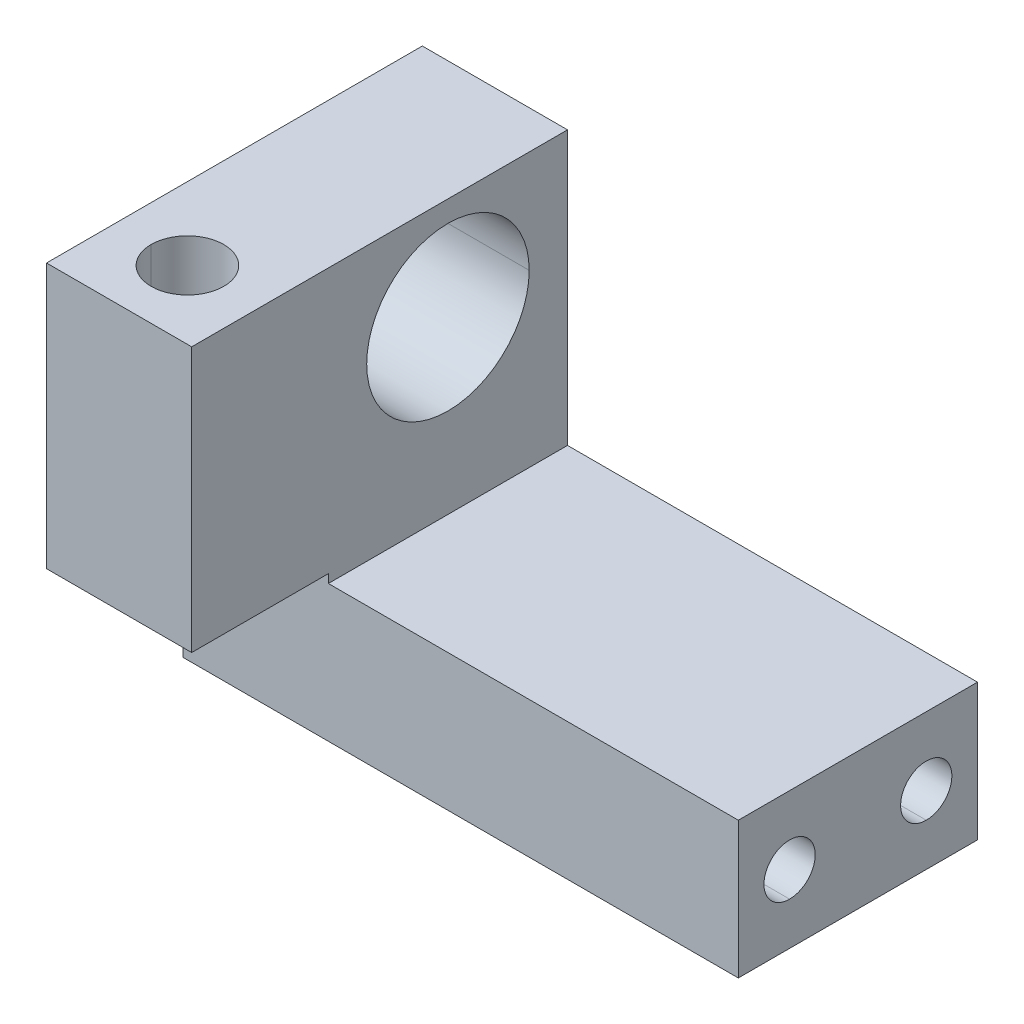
ISO-10303-21;
HEADER;
FILE_DESCRIPTION(('STEP AP214'),'2;1');
FILE_NAME('part.step','',(''),(''),'','','');
FILE_SCHEMA(('AUTOMOTIVE_DESIGN { 1 0 10303 214 1 1 1 1 }'));
ENDSEC;
DATA;
#1=APPLICATION_CONTEXT('core data for automotive mechanical design processes');
#2=APPLICATION_PROTOCOL_DEFINITION('international standard','automotive_design',2000,#1);
#3=PRODUCT_CONTEXT('',#1,'mechanical');
#4=PRODUCT('Part','Part','',(#3));
#5=PRODUCT_RELATED_PRODUCT_CATEGORY('part','',(#4));
#6=PRODUCT_DEFINITION_FORMATION('','',#4);
#7=PRODUCT_DEFINITION_CONTEXT('part definition',#1,'design');
#8=PRODUCT_DEFINITION('design','',#6,#7);
#9=PRODUCT_DEFINITION_SHAPE('','',#8);
#10=(LENGTH_UNIT() NAMED_UNIT(*) SI_UNIT(.MILLI.,.METRE.));
#11=(NAMED_UNIT(*) PLANE_ANGLE_UNIT() SI_UNIT($,.RADIAN.));
#12=(NAMED_UNIT(*) SI_UNIT($,.STERADIAN.) SOLID_ANGLE_UNIT());
#13=UNCERTAINTY_MEASURE_WITH_UNIT(LENGTH_MEASURE(1.E-05),#10,'distance_accuracy_value','');
#14=(GEOMETRIC_REPRESENTATION_CONTEXT(3) GLOBAL_UNCERTAINTY_ASSIGNED_CONTEXT((#13)) GLOBAL_UNIT_ASSIGNED_CONTEXT((#10,
#11,#12)) REPRESENTATION_CONTEXT('',''));
#15=CARTESIAN_POINT('',(0.,0.,0.));
#16=DIRECTION('',(0.,0.,1.));
#17=DIRECTION('',(1.,0.,0.));
#18=AXIS2_PLACEMENT_3D('',#15,#16,#17);
#19=CARTESIAN_POINT('',(-38.1,12.6999999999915,22.2249999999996));
#20=DIRECTION('',(0.,-1.,0.));
#21=DIRECTION('',(0.,0.,-1.));
#22=AXIS2_PLACEMENT_3D('',#19,#20,#21);
#23=CYLINDRICAL_SURFACE('',#22,6.746875);
#24=CARTESIAN_POINT('',(-38.1,-11.1125000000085,22.2249999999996));
#25=DIRECTION('',(0.,-1.,0.));
#26=DIRECTION('',(0.,0.,-1.));
#27=AXIS2_PLACEMENT_3D('',#24,#25,#26);
#28=CIRCLE('',#27,6.746875);
#29=CARTESIAN_POINT('',(-44.846875,-11.1125000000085,22.2249999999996));
#30=VERTEX_POINT('',#29);
#31=CARTESIAN_POINT('',(-31.353125,-11.1125000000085,22.2249999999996));
#32=VERTEX_POINT('',#31);
#33=EDGE_CURVE('E140',#30,#32,#28,.F.);
#34=ORIENTED_EDGE('',*,*,#33,.F.);
#35=DIRECTION('',(0.,-1.,0.));
#36=VECTOR('',#35,1.);
#37=CARTESIAN_POINT('',(-44.846875,12.6999999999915,22.2249999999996));
#38=LINE('',#37,#36);
#39=CARTESIAN_POINT('',(-44.846875,38.0999999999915,22.2249999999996));
#40=VERTEX_POINT('',#39);
#41=EDGE_CURVE('E132',#30,#40,#38,.F.);
#42=ORIENTED_EDGE('',*,*,#41,.T.);
#43=CARTESIAN_POINT('',(-38.1,38.0999999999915,22.2249999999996));
#44=DIRECTION('',(0.,-1.,0.));
#45=DIRECTION('',(0.,0.,-1.));
#46=AXIS2_PLACEMENT_3D('',#43,#44,#45);
#47=CIRCLE('',#46,6.746875);
#48=CARTESIAN_POINT('',(-31.353125,38.0999999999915,22.2249999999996));
#49=VERTEX_POINT('',#48);
#50=EDGE_CURVE('E189',#49,#40,#47,.T.);
#51=ORIENTED_EDGE('',*,*,#50,.F.);
#52=DIRECTION('',(0.,-1.,0.));
#53=VECTOR('',#52,1.);
#54=CARTESIAN_POINT('',(-31.353125,12.6999999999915,22.2249999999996));
#55=LINE('',#54,#53);
#56=EDGE_CURVE('E127',#49,#32,#55,.T.);
#57=ORIENTED_EDGE('',*,*,#56,.T.);
#58=EDGE_LOOP('',(#34,#42,#51,#57));
#59=FACE_BOUND('',#58,.T.);
#60=ADVANCED_FACE('F16',(#59),#23,.F.);
#61=CARTESIAN_POINT('',(-38.1,12.6999999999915,22.2249999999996));
#62=DIRECTION('',(0.,-1.,0.));
#63=DIRECTION('',(0.,0.,-1.));
#64=AXIS2_PLACEMENT_3D('',#61,#62,#63);
#65=CYLINDRICAL_SURFACE('',#64,6.746875);
#66=CARTESIAN_POINT('',(-38.1,38.0999999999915,22.2249999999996));
#67=DIRECTION('',(0.,-1.,0.));
#68=DIRECTION('',(0.,0.,-1.));
#69=AXIS2_PLACEMENT_3D('',#66,#67,#68);
#70=CIRCLE('',#69,6.746875);
#71=EDGE_CURVE('E137',#40,#49,#70,.T.);
#72=ORIENTED_EDGE('',*,*,#71,.F.);
#73=ORIENTED_EDGE('',*,*,#41,.F.);
#74=CARTESIAN_POINT('',(-38.1,-11.1125000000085,22.2249999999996));
#75=DIRECTION('',(0.,-1.,0.));
#76=DIRECTION('',(0.,0.,-1.));
#77=AXIS2_PLACEMENT_3D('',#74,#75,#76);
#78=CIRCLE('',#77,6.746875);
#79=EDGE_CURVE('E19',#32,#30,#78,.F.);
#80=ORIENTED_EDGE('',*,*,#79,.F.);
#81=ORIENTED_EDGE('',*,*,#56,.F.);
#82=EDGE_LOOP('',(#72,#73,#80,#81));
#83=FACE_BOUND('',#82,.T.);
#84=ADVANCED_FACE('F133',(#83),#65,.F.);
#85=CARTESIAN_POINT('',(19.84375,-25.3999999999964,-25.4));
#86=DIRECTION('',(-1.,0.,0.));
#87=DIRECTION('',(0.,0.,1.));
#88=AXIS2_PLACEMENT_3D('',#85,#86,#87);
#89=PLANE('',#88);
#90=CARTESIAN_POINT('',(19.84375,-25.3999999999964,-25.4));
#91=DIRECTION('',(-1.,0.,0.));
#92=DIRECTION('',(0.,0.,1.));
#93=AXIS2_PLACEMENT_3D('',#90,#91,#92);
#94=CIRCLE('',#93,4.7625);
#95=CARTESIAN_POINT('',(19.84375,-30.1624999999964,-25.4));
#96=VERTEX_POINT('',#95);
#97=CARTESIAN_POINT('',(19.84375,-20.6374999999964,-25.4));
#98=VERTEX_POINT('',#97);
#99=EDGE_CURVE('E177',#96,#98,#94,.F.);
#100=ORIENTED_EDGE('',*,*,#99,.T.);
#101=CARTESIAN_POINT('',(19.84375,-25.3999999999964,-25.4));
#102=DIRECTION('',(-1.,0.,0.));
#103=DIRECTION('',(0.,0.,1.));
#104=AXIS2_PLACEMENT_3D('',#101,#102,#103);
#105=CIRCLE('',#104,4.7625);
#106=EDGE_CURVE('E174',#98,#96,#105,.F.);
#107=ORIENTED_EDGE('',*,*,#106,.T.);
#108=EDGE_LOOP('',(#100,#107));
#109=FACE_BOUND('',#108,.T.);
#110=ADVANCED_FACE('F340',(#109),#89,.F.);
#111=CARTESIAN_POINT('',(19.84375,-25.3999999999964,0.));
#112=DIRECTION('',(-1.,0.,0.));
#113=DIRECTION('',(0.,0.,1.));
#114=AXIS2_PLACEMENT_3D('',#111,#112,#113);
#115=PLANE('',#114);
#116=CARTESIAN_POINT('',(19.84375,-25.3999999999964,0.));
#117=DIRECTION('',(-1.,0.,0.));
#118=DIRECTION('',(0.,0.,1.));
#119=AXIS2_PLACEMENT_3D('',#116,#117,#118);
#120=CIRCLE('',#119,4.7625);
#121=CARTESIAN_POINT('',(19.84375,-30.1624999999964,0.));
#122=VERTEX_POINT('',#121);
#123=CARTESIAN_POINT('',(19.84375,-20.6374999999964,0.));
#124=VERTEX_POINT('',#123);
#125=EDGE_CURVE('E171',#122,#124,#120,.F.);
#126=ORIENTED_EDGE('',*,*,#125,.T.);
#127=CARTESIAN_POINT('',(19.84375,-25.3999999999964,0.));
#128=DIRECTION('',(-1.,0.,0.));
#129=DIRECTION('',(0.,0.,1.));
#130=AXIS2_PLACEMENT_3D('',#127,#128,#129);
#131=CIRCLE('',#130,4.7625);
#132=EDGE_CURVE('E167',#124,#122,#131,.F.);
#133=ORIENTED_EDGE('',*,*,#132,.T.);
#134=EDGE_LOOP('',(#126,#133));
#135=FACE_BOUND('',#134,.T.);
#136=ADVANCED_FACE('F337',(#135),#115,.F.);
#137=CARTESIAN_POINT('',(-38.1,-11.1125000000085,22.2249999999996));
#138=DIRECTION('',(0.,-1.,0.));
#139=DIRECTION('',(0.,0.,-1.));
#140=AXIS2_PLACEMENT_3D('',#137,#138,#139);
#141=PLANE('',#140);
#142=DIRECTION('',(0.,0.,1.));
#143=VECTOR('',#142,1.);
#144=CARTESIAN_POINT('',(-51.59375,-11.1125000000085,15.8749999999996));
#145=LINE('',#144,#143);
#146=CARTESIAN_POINT('',(-51.59375,-11.1125000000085,9.52499999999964));
#147=VERTEX_POINT('',#146);
#148=CARTESIAN_POINT('',(-51.59375,-11.1125000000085,34.9249999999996));
#149=VERTEX_POINT('',#148);
#150=EDGE_CURVE('E205',#147,#149,#145,.T.);
#151=ORIENTED_EDGE('',*,*,#150,.F.);
#152=DIRECTION('',(1.,0.,0.));
#153=VECTOR('',#152,1.);
#154=CARTESIAN_POINT('',(-5.55625,-11.1125000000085,9.52499999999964));
#155=LINE('',#154,#153);
#156=CARTESIAN_POINT('',(-24.60625,-11.1125000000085,9.52499999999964));
#157=VERTEX_POINT('',#156);
#158=EDGE_CURVE('E220',#157,#147,#155,.F.);
#159=ORIENTED_EDGE('',*,*,#158,.F.);
#160=DIRECTION('',(0.,0.,-1.));
#161=VECTOR('',#160,1.);
#162=CARTESIAN_POINT('',(-24.60625,-11.1125000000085,15.8749999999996));
#163=LINE('',#162,#161);
#164=CARTESIAN_POINT('',(-24.60625,-11.1125000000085,34.9249999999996));
#165=VERTEX_POINT('',#164);
#166=EDGE_CURVE('E183',#165,#157,#163,.T.);
#167=ORIENTED_EDGE('',*,*,#166,.F.);
#168=DIRECTION('',(-1.,0.,0.));
#169=VECTOR('',#168,1.);
#170=CARTESIAN_POINT('',(-24.60625,-11.1125000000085,34.9249999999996));
#171=LINE('',#170,#169);
#172=EDGE_CURVE('E142',#165,#149,#171,.T.);
#173=ORIENTED_EDGE('',*,*,#172,.T.);
#174=EDGE_LOOP('',(#151,#159,#167,#173));
#175=FACE_BOUND('',#174,.T.);
#176=ORIENTED_EDGE('',*,*,#79,.T.);
#177=ORIENTED_EDGE('',*,*,#33,.T.);
#178=EDGE_LOOP('',(#176,#177));
#179=FACE_BOUND('',#178,.T.);
#180=ADVANCED_FACE('F143',(#175,#179),#141,.T.);
#181=CARTESIAN_POINT('',(-24.60625,-12.7000000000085,34.9249999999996));
#182=DIRECTION('',(0.,0.,-1.));
#183=DIRECTION('',(-1.,0.,0.));
#184=AXIS2_PLACEMENT_3D('',#181,#182,#183);
#185=PLANE('',#184);
#186=DIRECTION('',(0.,1.,0.));
#187=VECTOR('',#186,1.);
#188=CARTESIAN_POINT('',(-24.60625,38.1,34.9249999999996));
#189=LINE('',#188,#187);
#190=CARTESIAN_POINT('',(-24.60625,38.0999999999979,34.9249999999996));
#191=VERTEX_POINT('',#190);
#192=EDGE_CURVE('E179',#191,#165,#189,.F.);
#193=ORIENTED_EDGE('',*,*,#192,.F.);
#194=DIRECTION('',(1.,0.,0.));
#195=VECTOR('',#194,1.);
#196=CARTESIAN_POINT('',(-51.59375,38.1,34.9249999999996));
#197=LINE('',#196,#195);
#198=CARTESIAN_POINT('',(-51.59375,38.0999999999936,34.9249999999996));
#199=VERTEX_POINT('',#198);
#200=EDGE_CURVE('E187',#199,#191,#197,.T.);
#201=ORIENTED_EDGE('',*,*,#200,.F.);
#202=DIRECTION('',(0.,1.,0.));
#203=VECTOR('',#202,1.);
#204=CARTESIAN_POINT('',(-51.59375,-27.7622000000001,34.9249999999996));
#205=LINE('',#204,#203);
#206=EDGE_CURVE('E211',#149,#199,#205,.T.);
#207=ORIENTED_EDGE('',*,*,#206,.F.);
#208=ORIENTED_EDGE('',*,*,#172,.F.);
#209=EDGE_LOOP('',(#193,#201,#207,#208));
#210=FACE_BOUND('',#209,.T.);
#211=ADVANCED_FACE('F212',(#210),#185,.F.);
#212=CARTESIAN_POINT('',(-37.30625,19.0500000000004,-12.7000000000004));
#213=DIRECTION('',(1.,0.,0.));
#214=DIRECTION('',(0.,1.,0.));
#215=AXIS2_PLACEMENT_3D('',#212,#213,#214);
#216=CYLINDRICAL_SURFACE('',#215,15.1003);
#217=CARTESIAN_POINT('',(-24.60625,19.0500000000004,-12.7000000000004));
#218=DIRECTION('',(1.,0.,0.));
#219=DIRECTION('',(0.,1.,0.));
#220=AXIS2_PLACEMENT_3D('',#217,#218,#219);
#221=CIRCLE('',#220,15.1003);
#222=CARTESIAN_POINT('',(-24.60625,19.0500000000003,-27.8003000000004));
#223=VERTEX_POINT('',#222);
#224=CARTESIAN_POINT('',(-24.60625,19.0500000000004,2.40029999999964));
#225=VERTEX_POINT('',#224);
#226=EDGE_CURVE('E180',#223,#225,#221,.F.);
#227=ORIENTED_EDGE('',*,*,#226,.F.);
#228=DIRECTION('',(1.,0.,0.));
#229=VECTOR('',#228,1.);
#230=CARTESIAN_POINT('',(-37.30625,19.0500000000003,-27.8003000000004));
#231=LINE('',#230,#229);
#232=CARTESIAN_POINT('',(-51.59375,19.0500000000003,-27.8003000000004));
#233=VERTEX_POINT('',#232);
#234=EDGE_CURVE('E192',#223,#233,#231,.F.);
#235=ORIENTED_EDGE('',*,*,#234,.T.);
#236=CARTESIAN_POINT('',(-51.59375,19.0500000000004,-12.7000000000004));
#237=DIRECTION('',(1.,0.,0.));
#238=DIRECTION('',(0.,1.,0.));
#239=AXIS2_PLACEMENT_3D('',#236,#237,#238);
#240=CIRCLE('',#239,15.1003);
#241=CARTESIAN_POINT('',(-51.59375,19.0500000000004,2.40029999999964));
#242=VERTEX_POINT('',#241);
#243=EDGE_CURVE('E163',#242,#233,#240,.T.);
#244=ORIENTED_EDGE('',*,*,#243,.F.);
#245=DIRECTION('',(1.,0.,0.));
#246=VECTOR('',#245,1.);
#247=CARTESIAN_POINT('',(-37.30625,19.0500000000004,2.40029999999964));
#248=LINE('',#247,#246);
#249=EDGE_CURVE('E190',#242,#225,#248,.T.);
#250=ORIENTED_EDGE('',*,*,#249,.T.);
#251=EDGE_LOOP('',(#227,#235,#244,#250));
#252=FACE_BOUND('',#251,.T.);
#253=ADVANCED_FACE('F313',(#252),#216,.F.);
#254=CARTESIAN_POINT('',(-37.30625,19.0500000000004,-12.7000000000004));
#255=DIRECTION('',(1.,0.,0.));
#256=DIRECTION('',(0.,1.,0.));
#257=AXIS2_PLACEMENT_3D('',#254,#255,#256);
#258=CYLINDRICAL_SURFACE('',#257,15.1003);
#259=CARTESIAN_POINT('',(-51.59375,19.0500000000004,-12.7000000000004));
#260=DIRECTION('',(1.,0.,0.));
#261=DIRECTION('',(0.,1.,0.));
#262=AXIS2_PLACEMENT_3D('',#259,#260,#261);
#263=CIRCLE('',#262,15.1003);
#264=EDGE_CURVE('E159',#233,#242,#263,.T.);
#265=ORIENTED_EDGE('',*,*,#264,.F.);
#266=ORIENTED_EDGE('',*,*,#234,.F.);
#267=CARTESIAN_POINT('',(-24.60625,19.0500000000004,-12.7000000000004));
#268=DIRECTION('',(1.,0.,0.));
#269=DIRECTION('',(0.,1.,0.));
#270=AXIS2_PLACEMENT_3D('',#267,#268,#269);
#271=CIRCLE('',#270,15.1003);
#272=EDGE_CURVE('E184',#225,#223,#271,.F.);
#273=ORIENTED_EDGE('',*,*,#272,.F.);
#274=ORIENTED_EDGE('',*,*,#249,.F.);
#275=EDGE_LOOP('',(#265,#266,#273,#274));
#276=FACE_BOUND('',#275,.T.);
#277=ADVANCED_FACE('F315',(#276),#258,.F.);
#278=CARTESIAN_POINT('',(-51.59375,38.1,15.8749999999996));
#279=DIRECTION('',(0.,1.,0.));
#280=DIRECTION('',(0.,0.,1.));
#281=AXIS2_PLACEMENT_3D('',#278,#279,#280);
#282=PLANE('',#281);
#283=DIRECTION('',(0.,0.,1.));
#284=VECTOR('',#283,1.);
#285=CARTESIAN_POINT('',(-51.59375,38.0999999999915,15.8749999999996));
#286=LINE('',#285,#284);
#287=CARTESIAN_POINT('',(-51.59375,38.0999999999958,-34.9249999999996));
#288=VERTEX_POINT('',#287);
#289=EDGE_CURVE('E215',#199,#288,#286,.F.);
#290=ORIENTED_EDGE('',*,*,#289,.F.);
#291=ORIENTED_EDGE('',*,*,#200,.T.);
#292=DIRECTION('',(0.,0.,-1.));
#293=VECTOR('',#292,1.);
#294=CARTESIAN_POINT('',(-24.60625,38.1,15.8749999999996));
#295=LINE('',#294,#293);
#296=CARTESIAN_POINT('',(-24.60625,38.1,-34.9249999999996));
#297=VERTEX_POINT('',#296);
#298=EDGE_CURVE('E240',#297,#191,#295,.F.);
#299=ORIENTED_EDGE('',*,*,#298,.F.);
#300=DIRECTION('',(-1.,0.,0.));
#301=VECTOR('',#300,1.);
#302=CARTESIAN_POINT('',(-5.55625,38.1,-34.9249999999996));
#303=LINE('',#302,#301);
#304=EDGE_CURVE('E255',#288,#297,#303,.F.);
#305=ORIENTED_EDGE('',*,*,#304,.F.);
#306=EDGE_LOOP('',(#290,#291,#299,#305));
#307=FACE_BOUND('',#306,.T.);
#308=ORIENTED_EDGE('',*,*,#50,.T.);
#309=ORIENTED_EDGE('',*,*,#71,.T.);
#310=EDGE_LOOP('',(#308,#309));
#311=FACE_BOUND('',#310,.T.);
#312=ADVANCED_FACE('F244',(#307,#311),#282,.T.);
#313=CARTESIAN_POINT('',(-24.60625,38.1,15.8749999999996));
#314=DIRECTION('',(1.,0.,0.));
#315=DIRECTION('',(0.,0.,-1.));
#316=AXIS2_PLACEMENT_3D('',#313,#314,#315);
#317=PLANE('',#316);
#318=ORIENTED_EDGE('',*,*,#298,.T.);
#319=ORIENTED_EDGE('',*,*,#192,.T.);
#320=ORIENTED_EDGE('',*,*,#166,.T.);
#321=DIRECTION('',(0.,1.,0.));
#322=VECTOR('',#321,1.);
#323=CARTESIAN_POINT('',(-24.60625,0.,9.52499999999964));
#324=LINE('',#323,#322);
#325=CARTESIAN_POINT('',(-24.60625,-12.7,9.52499999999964));
#326=VERTEX_POINT('',#325);
#327=EDGE_CURVE('E222',#326,#157,#324,.T.);
#328=ORIENTED_EDGE('',*,*,#327,.F.);
#329=DIRECTION('',(0.,0.,-1.));
#330=VECTOR('',#329,1.);
#331=CARTESIAN_POINT('',(-24.60625,-12.7,-6.35000000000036));
#332=LINE('',#331,#330);
#333=CARTESIAN_POINT('',(-24.60625,-12.7,-34.9249999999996));
#334=VERTEX_POINT('',#333);
#335=EDGE_CURVE('E231',#326,#334,#332,.T.);
#336=ORIENTED_EDGE('',*,*,#335,.T.);
#337=DIRECTION('',(0.,1.,0.));
#338=VECTOR('',#337,1.);
#339=CARTESIAN_POINT('',(-24.60625,0.,-34.9249999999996));
#340=LINE('',#339,#338);
#341=EDGE_CURVE('E251',#297,#334,#340,.F.);
#342=ORIENTED_EDGE('',*,*,#341,.F.);
#343=EDGE_LOOP('',(#318,#319,#320,#328,#336,#342));
#344=FACE_BOUND('',#343,.T.);
#345=ORIENTED_EDGE('',*,*,#272,.T.);
#346=ORIENTED_EDGE('',*,*,#226,.T.);
#347=EDGE_LOOP('',(#345,#346));
#348=FACE_BOUND('',#347,.T.);
#349=ADVANCED_FACE('F248',(#344,#348),#317,.T.);
#350=CARTESIAN_POINT('',(35.71875,-25.3999999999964,-25.4));
#351=DIRECTION('',(-1.,0.,0.));
#352=DIRECTION('',(0.,0.,1.));
#353=AXIS2_PLACEMENT_3D('',#350,#351,#352);
#354=CYLINDRICAL_SURFACE('',#353,4.7625);
#355=CARTESIAN_POINT('',(51.59375,-25.3999999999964,-25.4));
#356=DIRECTION('',(-1.,0.,0.));
#357=DIRECTION('',(0.,0.,1.));
#358=AXIS2_PLACEMENT_3D('',#355,#356,#357);
#359=CIRCLE('',#358,4.7625);
#360=CARTESIAN_POINT('',(51.59375,-30.1624999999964,-25.4));
#361=VERTEX_POINT('',#360);
#362=CARTESIAN_POINT('',(51.59375,-20.6374999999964,-25.4));
#363=VERTEX_POINT('',#362);
#364=EDGE_CURVE('E156',#361,#363,#359,.F.);
#365=ORIENTED_EDGE('',*,*,#364,.T.);
#366=DIRECTION('',(-1.,0.,0.));
#367=VECTOR('',#366,1.);
#368=CARTESIAN_POINT('',(35.71875,-20.6374999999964,-25.4));
#369=LINE('',#368,#367);
#370=EDGE_CURVE('E176',#363,#98,#369,.T.);
#371=ORIENTED_EDGE('',*,*,#370,.T.);
#372=ORIENTED_EDGE('',*,*,#99,.F.);
#373=DIRECTION('',(-1.,0.,0.));
#374=VECTOR('',#373,1.);
#375=CARTESIAN_POINT('',(35.71875,-30.1624999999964,-25.4));
#376=LINE('',#375,#374);
#377=EDGE_CURVE('E173',#96,#361,#376,.F.);
#378=ORIENTED_EDGE('',*,*,#377,.T.);
#379=EDGE_LOOP('',(#365,#371,#372,#378));
#380=FACE_BOUND('',#379,.T.);
#381=ADVANCED_FACE('F317',(#380),#354,.F.);
#382=CARTESIAN_POINT('',(35.71875,-25.3999999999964,-25.4));
#383=DIRECTION('',(-1.,0.,0.));
#384=DIRECTION('',(0.,0.,1.));
#385=AXIS2_PLACEMENT_3D('',#382,#383,#384);
#386=CYLINDRICAL_SURFACE('',#385,4.7625);
#387=ORIENTED_EDGE('',*,*,#106,.F.);
#388=ORIENTED_EDGE('',*,*,#370,.F.);
#389=CARTESIAN_POINT('',(51.59375,-25.3999999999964,-25.4));
#390=DIRECTION('',(-1.,0.,0.));
#391=DIRECTION('',(0.,0.,1.));
#392=AXIS2_PLACEMENT_3D('',#389,#390,#391);
#393=CIRCLE('',#392,4.7625);
#394=EDGE_CURVE('E153',#363,#361,#393,.F.);
#395=ORIENTED_EDGE('',*,*,#394,.T.);
#396=ORIENTED_EDGE('',*,*,#377,.F.);
#397=EDGE_LOOP('',(#387,#388,#395,#396));
#398=FACE_BOUND('',#397,.T.);
#399=ADVANCED_FACE('F323',(#398),#386,.F.);
#400=CARTESIAN_POINT('',(35.71875,-25.3999999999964,0.));
#401=DIRECTION('',(-1.,0.,0.));
#402=DIRECTION('',(0.,0.,1.));
#403=AXIS2_PLACEMENT_3D('',#400,#401,#402);
#404=CYLINDRICAL_SURFACE('',#403,4.7625);
#405=CARTESIAN_POINT('',(51.59375,-25.3999999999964,0.));
#406=DIRECTION('',(-1.,0.,0.));
#407=DIRECTION('',(0.,0.,1.));
#408=AXIS2_PLACEMENT_3D('',#405,#406,#407);
#409=CIRCLE('',#408,4.7625);
#410=CARTESIAN_POINT('',(51.59375,-30.1624999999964,0.));
#411=VERTEX_POINT('',#410);
#412=CARTESIAN_POINT('',(51.59375,-20.6374999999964,0.));
#413=VERTEX_POINT('',#412);
#414=EDGE_CURVE('E151',#411,#413,#409,.F.);
#415=ORIENTED_EDGE('',*,*,#414,.T.);
#416=DIRECTION('',(-1.,0.,0.));
#417=VECTOR('',#416,1.);
#418=CARTESIAN_POINT('',(35.71875,-20.6374999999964,0.));
#419=LINE('',#418,#417);
#420=EDGE_CURVE('E170',#413,#124,#419,.T.);
#421=ORIENTED_EDGE('',*,*,#420,.T.);
#422=ORIENTED_EDGE('',*,*,#125,.F.);
#423=DIRECTION('',(-1.,0.,0.));
#424=VECTOR('',#423,1.);
#425=CARTESIAN_POINT('',(35.71875,-30.1624999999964,0.));
#426=LINE('',#425,#424);
#427=EDGE_CURVE('E169',#122,#411,#426,.F.);
#428=ORIENTED_EDGE('',*,*,#427,.T.);
#429=EDGE_LOOP('',(#415,#421,#422,#428));
#430=FACE_BOUND('',#429,.T.);
#431=ADVANCED_FACE('F296',(#430),#404,.F.);
#432=CARTESIAN_POINT('',(35.71875,-25.3999999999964,0.));
#433=DIRECTION('',(-1.,0.,0.));
#434=DIRECTION('',(0.,0.,1.));
#435=AXIS2_PLACEMENT_3D('',#432,#433,#434);
#436=CYLINDRICAL_SURFACE('',#435,4.7625);
#437=ORIENTED_EDGE('',*,*,#132,.F.);
#438=ORIENTED_EDGE('',*,*,#420,.F.);
#439=CARTESIAN_POINT('',(51.59375,-25.3999999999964,0.));
#440=DIRECTION('',(-1.,0.,0.));
#441=DIRECTION('',(0.,0.,1.));
#442=AXIS2_PLACEMENT_3D('',#439,#440,#441);
#443=CIRCLE('',#442,4.7625);
#444=EDGE_CURVE('E147',#413,#411,#443,.F.);
#445=ORIENTED_EDGE('',*,*,#444,.T.);
#446=ORIENTED_EDGE('',*,*,#427,.F.);
#447=EDGE_LOOP('',(#437,#438,#445,#446));
#448=FACE_BOUND('',#447,.T.);
#449=ADVANCED_FACE('F288',(#448),#436,.F.);
#450=CARTESIAN_POINT('',(13.49375,-12.7,-6.35000000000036));
#451=DIRECTION('',(0.,-1.,0.));
#452=DIRECTION('',(0.,0.,-1.));
#453=AXIS2_PLACEMENT_3D('',#450,#451,#452);
#454=PLANE('',#453);
#455=DIRECTION('',(0.,0.,1.));
#456=VECTOR('',#455,1.);
#457=CARTESIAN_POINT('',(51.59375,-12.7,-6.35000000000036));
#458=LINE('',#457,#456);
#459=CARTESIAN_POINT('',(51.59375,-12.7,9.52499999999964));
#460=VERTEX_POINT('',#459);
#461=CARTESIAN_POINT('',(51.59375,-12.7,-34.9249999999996));
#462=VERTEX_POINT('',#461);
#463=EDGE_CURVE('E150',#460,#462,#458,.F.);
#464=ORIENTED_EDGE('',*,*,#463,.T.);
#465=DIRECTION('',(-1.,0.,0.));
#466=VECTOR('',#465,1.);
#467=CARTESIAN_POINT('',(-5.55625,-12.7,-34.9249999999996));
#468=LINE('',#467,#466);
#469=EDGE_CURVE('E158',#334,#462,#468,.F.);
#470=ORIENTED_EDGE('',*,*,#469,.F.);
#471=ORIENTED_EDGE('',*,*,#335,.F.);
#472=DIRECTION('',(1.,0.,0.));
#473=VECTOR('',#472,1.);
#474=CARTESIAN_POINT('',(-5.55625,-12.7,9.52499999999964));
#475=LINE('',#474,#473);
#476=EDGE_CURVE('E228',#460,#326,#475,.F.);
#477=ORIENTED_EDGE('',*,*,#476,.F.);
#478=EDGE_LOOP('',(#464,#470,#471,#477));
#479=FACE_BOUND('',#478,.T.);
#480=ADVANCED_FACE('F286',(#479),#454,.F.);
#481=CARTESIAN_POINT('',(-5.55625,0.,9.52499999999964));
#482=DIRECTION('',(0.,0.,1.));
#483=DIRECTION('',(1.,0.,0.));
#484=AXIS2_PLACEMENT_3D('',#481,#482,#483);
#485=PLANE('',#484);
#486=ORIENTED_EDGE('',*,*,#327,.T.);
#487=ORIENTED_EDGE('',*,*,#158,.T.);
#488=DIRECTION('',(0.,1.,0.));
#489=VECTOR('',#488,1.);
#490=CARTESIAN_POINT('',(-51.59375,-27.7622000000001,9.52499999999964));
#491=LINE('',#490,#489);
#492=CARTESIAN_POINT('',(-51.59375,-38.1,9.52499999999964));
#493=VERTEX_POINT('',#492);
#494=EDGE_CURVE('E166',#493,#147,#491,.T.);
#495=ORIENTED_EDGE('',*,*,#494,.F.);
#496=DIRECTION('',(1.,0.,0.));
#497=VECTOR('',#496,1.);
#498=CARTESIAN_POINT('',(0.,-38.1,9.52499999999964));
#499=LINE('',#498,#497);
#500=CARTESIAN_POINT('',(51.59375,-38.1,9.52499999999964));
#501=VERTEX_POINT('',#500);
#502=EDGE_CURVE('E270',#501,#493,#499,.F.);
#503=ORIENTED_EDGE('',*,*,#502,.F.);
#504=DIRECTION('',(0.,1.,0.));
#505=VECTOR('',#504,1.);
#506=CARTESIAN_POINT('',(51.59375,-38.1,9.52499999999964));
#507=LINE('',#506,#505);
#508=EDGE_CURVE('E272',#501,#460,#507,.T.);
#509=ORIENTED_EDGE('',*,*,#508,.T.);
#510=ORIENTED_EDGE('',*,*,#476,.T.);
#511=EDGE_LOOP('',(#486,#487,#495,#503,#509,#510));
#512=FACE_BOUND('',#511,.T.);
#513=ADVANCED_FACE('F285',(#512),#485,.T.);
#514=CARTESIAN_POINT('',(-51.59375,-27.7622000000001,15.8749999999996));
#515=DIRECTION('',(-1.,0.,0.));
#516=DIRECTION('',(0.,0.,1.));
#517=AXIS2_PLACEMENT_3D('',#514,#515,#516);
#518=PLANE('',#517);
#519=ORIENTED_EDGE('',*,*,#243,.T.);
#520=ORIENTED_EDGE('',*,*,#264,.T.);
#521=EDGE_LOOP('',(#519,#520));
#522=FACE_BOUND('',#521,.T.);
#523=DIRECTION('',(0.,0.,-1.));
#524=VECTOR('',#523,1.);
#525=CARTESIAN_POINT('',(-51.59375,-38.1,-12.7));
#526=LINE('',#525,#524);
#527=CARTESIAN_POINT('',(-51.59375,-38.1,-34.9249999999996));
#528=VERTEX_POINT('',#527);
#529=EDGE_CURVE('E264',#493,#528,#526,.T.);
#530=ORIENTED_EDGE('',*,*,#529,.F.);
#531=ORIENTED_EDGE('',*,*,#494,.T.);
#532=ORIENTED_EDGE('',*,*,#150,.T.);
#533=ORIENTED_EDGE('',*,*,#206,.T.);
#534=ORIENTED_EDGE('',*,*,#289,.T.);
#535=DIRECTION('',(0.,1.,0.));
#536=VECTOR('',#535,1.);
#537=CARTESIAN_POINT('',(-51.59375,0.,-34.9249999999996));
#538=LINE('',#537,#536);
#539=EDGE_CURVE('E162',#528,#288,#538,.T.);
#540=ORIENTED_EDGE('',*,*,#539,.F.);
#541=EDGE_LOOP('',(#530,#531,#532,#533,#534,#540));
#542=FACE_BOUND('',#541,.T.);
#543=ADVANCED_FACE('F219',(#522,#542),#518,.T.);
#544=CARTESIAN_POINT('',(-5.55625,0.,-34.9249999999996));
#545=DIRECTION('',(0.,0.,-1.));
#546=DIRECTION('',(-1.,0.,0.));
#547=AXIS2_PLACEMENT_3D('',#544,#545,#546);
#548=PLANE('',#547);
#549=DIRECTION('',(0.,1.,0.));
#550=VECTOR('',#549,1.);
#551=CARTESIAN_POINT('',(51.59375,-38.1,-34.9249999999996));
#552=LINE('',#551,#550);
#553=CARTESIAN_POINT('',(51.59375,-38.1,-34.9249999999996));
#554=VERTEX_POINT('',#553);
#555=EDGE_CURVE('E34',#462,#554,#552,.F.);
#556=ORIENTED_EDGE('',*,*,#555,.T.);
#557=DIRECTION('',(1.,0.,0.));
#558=VECTOR('',#557,1.);
#559=CARTESIAN_POINT('',(0.,-38.1,-34.9249999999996));
#560=LINE('',#559,#558);
#561=EDGE_CURVE('E25',#528,#554,#560,.T.);
#562=ORIENTED_EDGE('',*,*,#561,.F.);
#563=ORIENTED_EDGE('',*,*,#539,.T.);
#564=ORIENTED_EDGE('',*,*,#304,.T.);
#565=ORIENTED_EDGE('',*,*,#341,.T.);
#566=ORIENTED_EDGE('',*,*,#469,.T.);
#567=EDGE_LOOP('',(#556,#562,#563,#564,#565,#566));
#568=FACE_BOUND('',#567,.T.);
#569=ADVANCED_FACE('F258',(#568),#548,.T.);
#570=CARTESIAN_POINT('',(51.59375,-38.1,-6.35000000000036));
#571=DIRECTION('',(-1.,0.,0.));
#572=DIRECTION('',(0.,0.,1.));
#573=AXIS2_PLACEMENT_3D('',#570,#571,#572);
#574=PLANE('',#573);
#575=DIRECTION('',(0.,0.,-1.));
#576=VECTOR('',#575,1.);
#577=CARTESIAN_POINT('',(51.59375,-38.1,-12.7));
#578=LINE('',#577,#576);
#579=EDGE_CURVE('E11',#554,#501,#578,.F.);
#580=ORIENTED_EDGE('',*,*,#579,.F.);
#581=ORIENTED_EDGE('',*,*,#555,.F.);
#582=ORIENTED_EDGE('',*,*,#463,.F.);
#583=ORIENTED_EDGE('',*,*,#508,.F.);
#584=EDGE_LOOP('',(#580,#581,#582,#583));
#585=FACE_BOUND('',#584,.T.);
#586=ORIENTED_EDGE('',*,*,#414,.F.);
#587=ORIENTED_EDGE('',*,*,#444,.F.);
#588=EDGE_LOOP('',(#586,#587));
#589=FACE_BOUND('',#588,.T.);
#590=ORIENTED_EDGE('',*,*,#364,.F.);
#591=ORIENTED_EDGE('',*,*,#394,.F.);
#592=EDGE_LOOP('',(#590,#591));
#593=FACE_BOUND('',#592,.T.);
#594=ADVANCED_FACE('F281',(#585,#589,#593),#574,.F.);
#595=CARTESIAN_POINT('',(0.,-38.1,-12.7));
#596=DIRECTION('',(0.,-1.,0.));
#597=DIRECTION('',(0.,0.,-1.));
#598=AXIS2_PLACEMENT_3D('',#595,#596,#597);
#599=PLANE('',#598);
#600=ORIENTED_EDGE('',*,*,#561,.T.);
#601=ORIENTED_EDGE('',*,*,#579,.T.);
#602=ORIENTED_EDGE('',*,*,#502,.T.);
#603=ORIENTED_EDGE('',*,*,#529,.T.);
#604=EDGE_LOOP('',(#600,#601,#602,#603));
#605=FACE_BOUND('',#604,.T.);
#606=ADVANCED_FACE('F269',(#605),#599,.T.);
#607=CLOSED_SHELL('',(#60,#84,#110,#136,#180,#211,#253,#277,#312,#349,#381,#399,#431,#449,#480,
#513,#543,#569,#594,#606));
#608=MANIFOLD_SOLID_BREP('B1',#607);
#609=ADVANCED_BREP_SHAPE_REPRESENTATION('',(#18,#608),#14);
#610=SHAPE_DEFINITION_REPRESENTATION(#9,#609);
ENDSEC;
END-ISO-10303-21;
